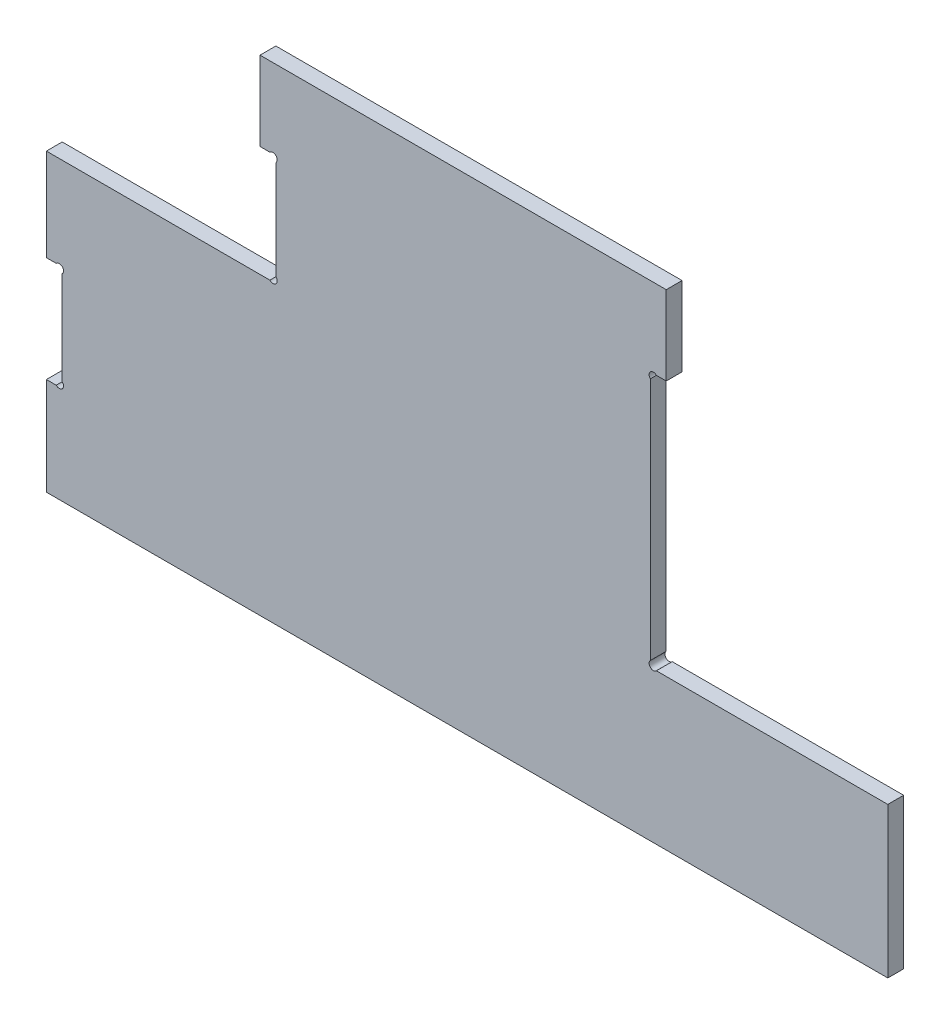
ISO-10303-21;
HEADER;
FILE_DESCRIPTION(('STEP AP214'),'2;1');
FILE_NAME('part.step','',(''),(''),'','','');
FILE_SCHEMA(('AUTOMOTIVE_DESIGN { 1 0 10303 214 1 1 1 1 }'));
ENDSEC;
DATA;
#1=APPLICATION_CONTEXT('core data for automotive mechanical design processes');
#2=APPLICATION_PROTOCOL_DEFINITION('international standard','automotive_design',2000,#1);
#3=PRODUCT_CONTEXT('',#1,'mechanical');
#4=PRODUCT('Part','Part','',(#3));
#5=PRODUCT_RELATED_PRODUCT_CATEGORY('part','',(#4));
#6=PRODUCT_DEFINITION_FORMATION('','',#4);
#7=PRODUCT_DEFINITION_CONTEXT('part definition',#1,'design');
#8=PRODUCT_DEFINITION('design','',#6,#7);
#9=PRODUCT_DEFINITION_SHAPE('','',#8);
#10=(LENGTH_UNIT() NAMED_UNIT(*) SI_UNIT(.MILLI.,.METRE.));
#11=(NAMED_UNIT(*) PLANE_ANGLE_UNIT() SI_UNIT($,.RADIAN.));
#12=(NAMED_UNIT(*) SI_UNIT($,.STERADIAN.) SOLID_ANGLE_UNIT());
#13=UNCERTAINTY_MEASURE_WITH_UNIT(LENGTH_MEASURE(1.E-05),#10,'distance_accuracy_value','');
#14=(GEOMETRIC_REPRESENTATION_CONTEXT(3) GLOBAL_UNCERTAINTY_ASSIGNED_CONTEXT((#13)) GLOBAL_UNIT_ASSIGNED_CONTEXT((#10,
#11,#12)) REPRESENTATION_CONTEXT('',''));
#15=CARTESIAN_POINT('',(0.,0.,0.));
#16=DIRECTION('',(0.,0.,1.));
#17=DIRECTION('',(1.,0.,0.));
#18=AXIS2_PLACEMENT_3D('',#15,#16,#17);
#19=CARTESIAN_POINT('',(-96.1825780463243,-108.030312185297,6.));
#20=DIRECTION('',(-1.,0.,0.));
#21=DIRECTION('',(0.,-1.,0.));
#22=AXIS2_PLACEMENT_3D('',#19,#20,#21);
#23=PLANE('',#22);
#24=DIRECTION('',(0.,0.,1.));
#25=VECTOR('',#24,1.);
#26=CARTESIAN_POINT('',(-96.1825780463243,-31.0303121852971,0.));
#27=LINE('',#26,#25);
#28=CARTESIAN_POINT('',(-96.1825780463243,-31.0303121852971,0.));
#29=VERTEX_POINT('',#28);
#30=CARTESIAN_POINT('',(-96.1825780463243,-31.0303121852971,6.));
#31=VERTEX_POINT('',#30);
#32=EDGE_CURVE('E219',#29,#31,#27,.T.);
#33=ORIENTED_EDGE('',*,*,#32,.T.);
#34=DIRECTION('',(0.,1.,0.));
#35=VECTOR('',#34,1.);
#36=CARTESIAN_POINT('',(-96.1825780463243,-108.030312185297,6.));
#37=LINE('',#36,#35);
#38=CARTESIAN_POINT('',(-96.1825780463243,3.96968781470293,6.));
#39=VERTEX_POINT('',#38);
#40=EDGE_CURVE('E222',#31,#39,#37,.T.);
#41=ORIENTED_EDGE('',*,*,#40,.T.);
#42=DIRECTION('',(0.,0.,-1.));
#43=VECTOR('',#42,1.);
#44=CARTESIAN_POINT('',(-96.1825780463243,3.96968781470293,6.));
#45=LINE('',#44,#43);
#46=CARTESIAN_POINT('',(-96.1825780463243,3.96968781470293,0.));
#47=VERTEX_POINT('',#46);
#48=EDGE_CURVE('E227',#39,#47,#45,.T.);
#49=ORIENTED_EDGE('',*,*,#48,.T.);
#50=DIRECTION('',(0.,-1.,0.));
#51=VECTOR('',#50,1.);
#52=CARTESIAN_POINT('',(-96.1825780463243,-108.030312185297,0.));
#53=LINE('',#52,#51);
#54=EDGE_CURVE('E230',#47,#29,#53,.T.);
#55=ORIENTED_EDGE('',*,*,#54,.T.);
#56=EDGE_LOOP('',(#33,#41,#49,#55));
#57=FACE_BOUND('',#56,.T.);
#58=ADVANCED_FACE('F32',(#57),#23,.T.);
#59=CARTESIAN_POINT('',(-15.1825780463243,75.9696878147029,6.));
#60=DIRECTION('',(1.,0.,0.));
#61=DIRECTION('',(0.,1.,0.));
#62=AXIS2_PLACEMENT_3D('',#59,#60,#61);
#63=PLANE('',#62);
#64=DIRECTION('',(0.,-1.,0.));
#65=VECTOR('',#64,1.);
#66=CARTESIAN_POINT('',(-15.1825780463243,75.9696878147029,0.));
#67=LINE('',#66,#65);
#68=CARTESIAN_POINT('',(-15.1825780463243,75.9696878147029,0.));
#69=VERTEX_POINT('',#68);
#70=CARTESIAN_POINT('',(-15.1825780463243,45.969687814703,0.));
#71=VERTEX_POINT('',#70);
#72=EDGE_CURVE('E264',#69,#71,#67,.T.);
#73=ORIENTED_EDGE('',*,*,#72,.T.);
#74=DIRECTION('',(0.,0.,1.));
#75=VECTOR('',#74,1.);
#76=CARTESIAN_POINT('',(-15.1825780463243,45.969687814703,0.));
#77=LINE('',#76,#75);
#78=CARTESIAN_POINT('',(-15.1825780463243,45.969687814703,6.));
#79=VERTEX_POINT('',#78);
#80=EDGE_CURVE('E196',#71,#79,#77,.T.);
#81=ORIENTED_EDGE('',*,*,#80,.T.);
#82=DIRECTION('',(0.,-1.,0.));
#83=VECTOR('',#82,1.);
#84=CARTESIAN_POINT('',(-15.1825780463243,75.9696878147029,6.));
#85=LINE('',#84,#83);
#86=CARTESIAN_POINT('',(-15.1825780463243,75.9696878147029,6.));
#87=VERTEX_POINT('',#86);
#88=EDGE_CURVE('E275',#87,#79,#85,.T.);
#89=ORIENTED_EDGE('',*,*,#88,.F.);
#90=DIRECTION('',(0.,0.,-1.));
#91=VECTOR('',#90,1.);
#92=CARTESIAN_POINT('',(-15.1825780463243,75.9696878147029,6.));
#93=LINE('',#92,#91);
#94=EDGE_CURVE('E279',#87,#69,#93,.T.);
#95=ORIENTED_EDGE('',*,*,#94,.T.);
#96=EDGE_LOOP('',(#73,#81,#89,#95));
#97=FACE_BOUND('',#96,.T.);
#98=ADVANCED_FACE('F408',(#97),#63,.F.);
#99=CARTESIAN_POINT('',(132.817421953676,75.9696878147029,6.));
#100=DIRECTION('',(-1.,0.,0.));
#101=DIRECTION('',(0.,-1.,0.));
#102=AXIS2_PLACEMENT_3D('',#99,#100,#101);
#103=PLANE('',#102);
#104=DIRECTION('',(0.,1.,0.));
#105=VECTOR('',#104,1.);
#106=CARTESIAN_POINT('',(132.817421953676,75.9696878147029,0.));
#107=LINE('',#106,#105);
#108=CARTESIAN_POINT('',(132.817421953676,-48.7684171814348,0.));
#109=VERTEX_POINT('',#108);
#110=CARTESIAN_POINT('',(132.817421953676,43.7077928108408,0.));
#111=VERTEX_POINT('',#110);
#112=EDGE_CURVE('E259',#109,#111,#107,.T.);
#113=ORIENTED_EDGE('',*,*,#112,.T.);
#114=DIRECTION('',(0.,0.,-1.));
#115=VECTOR('',#114,1.);
#116=CARTESIAN_POINT('',(132.817421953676,43.7077928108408,6.));
#117=LINE('',#116,#115);
#118=CARTESIAN_POINT('',(132.817421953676,43.7077928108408,6.));
#119=VERTEX_POINT('',#118);
#120=EDGE_CURVE('E355',#111,#119,#117,.F.);
#121=ORIENTED_EDGE('',*,*,#120,.T.);
#122=DIRECTION('',(0.,1.,0.));
#123=VECTOR('',#122,1.);
#124=CARTESIAN_POINT('',(132.817421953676,75.9696878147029,6.));
#125=LINE('',#124,#123);
#126=CARTESIAN_POINT('',(132.817421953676,-48.7684171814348,6.));
#127=VERTEX_POINT('',#126);
#128=EDGE_CURVE('E457',#127,#119,#125,.T.);
#129=ORIENTED_EDGE('',*,*,#128,.F.);
#130=DIRECTION('',(0.,0.,-1.));
#131=VECTOR('',#130,1.);
#132=CARTESIAN_POINT('',(132.817421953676,-48.7684171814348,6.));
#133=LINE('',#132,#131);
#134=EDGE_CURVE('E364',#127,#109,#133,.T.);
#135=ORIENTED_EDGE('',*,*,#134,.T.);
#136=EDGE_LOOP('',(#113,#121,#129,#135));
#137=FACE_BOUND('',#136,.T.);
#138=ADVANCED_FACE('F413',(#137),#103,.F.);
#139=CARTESIAN_POINT('',(222.817421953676,-51.030312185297,6.));
#140=DIRECTION('',(-1.,0.,0.));
#141=DIRECTION('',(0.,0.,1.));
#142=AXIS2_PLACEMENT_3D('',#139,#140,#141);
#143=PLANE('',#142);
#144=DIRECTION('',(0.,1.,0.));
#145=VECTOR('',#144,1.);
#146=CARTESIAN_POINT('',(222.817421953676,-51.030312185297,0.));
#147=LINE('',#146,#145);
#148=CARTESIAN_POINT('',(222.817421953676,-108.030312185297,0.));
#149=VERTEX_POINT('',#148);
#150=CARTESIAN_POINT('',(222.817421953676,-51.030312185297,0.));
#151=VERTEX_POINT('',#150);
#152=EDGE_CURVE('E254',#149,#151,#147,.T.);
#153=ORIENTED_EDGE('',*,*,#152,.T.);
#154=DIRECTION('',(0.,0.,-1.));
#155=VECTOR('',#154,1.);
#156=CARTESIAN_POINT('',(222.817421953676,-51.030312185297,6.));
#157=LINE('',#156,#155);
#158=CARTESIAN_POINT('',(222.817421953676,-51.030312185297,6.));
#159=VERTEX_POINT('',#158);
#160=EDGE_CURVE('E287',#159,#151,#157,.T.);
#161=ORIENTED_EDGE('',*,*,#160,.F.);
#162=DIRECTION('',(0.,1.,0.));
#163=VECTOR('',#162,1.);
#164=CARTESIAN_POINT('',(222.817421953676,-51.030312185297,6.));
#165=LINE('',#164,#163);
#166=CARTESIAN_POINT('',(222.817421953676,-108.030312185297,6.));
#167=VERTEX_POINT('',#166);
#168=EDGE_CURVE('E455',#167,#159,#165,.T.);
#169=ORIENTED_EDGE('',*,*,#168,.F.);
#170=DIRECTION('',(0.,0.,-1.));
#171=VECTOR('',#170,1.);
#172=CARTESIAN_POINT('',(222.817421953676,-108.030312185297,6.));
#173=LINE('',#172,#171);
#174=EDGE_CURVE('E273',#167,#149,#173,.T.);
#175=ORIENTED_EDGE('',*,*,#174,.T.);
#176=EDGE_LOOP('',(#153,#161,#169,#175));
#177=FACE_BOUND('',#176,.T.);
#178=ADVANCED_FACE('F34',(#177),#143,.F.);
#179=CARTESIAN_POINT('',(132.817421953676,-51.030312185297,6.));
#180=DIRECTION('',(0.,-1.,0.));
#181=DIRECTION('',(0.,0.,-1.));
#182=AXIS2_PLACEMENT_3D('',#179,#180,#181);
#183=PLANE('',#182);
#184=DIRECTION('',(-1.,0.,0.));
#185=VECTOR('',#184,1.);
#186=CARTESIAN_POINT('',(132.817421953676,-51.030312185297,0.));
#187=LINE('',#186,#185);
#188=CARTESIAN_POINT('',(135.079316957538,-51.030312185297,0.));
#189=VERTEX_POINT('',#188);
#190=EDGE_CURVE('E256',#151,#189,#187,.T.);
#191=ORIENTED_EDGE('',*,*,#190,.T.);
#192=DIRECTION('',(0.,0.,-1.));
#193=VECTOR('',#192,1.);
#194=CARTESIAN_POINT('',(135.079316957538,-51.030312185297,6.));
#195=LINE('',#194,#193);
#196=CARTESIAN_POINT('',(135.079316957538,-51.030312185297,6.));
#197=VERTEX_POINT('',#196);
#198=EDGE_CURVE('E361',#189,#197,#195,.F.);
#199=ORIENTED_EDGE('',*,*,#198,.T.);
#200=DIRECTION('',(-1.,0.,0.));
#201=VECTOR('',#200,1.);
#202=CARTESIAN_POINT('',(132.817421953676,-51.030312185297,6.));
#203=LINE('',#202,#201);
#204=EDGE_CURVE('E456',#159,#197,#203,.T.);
#205=ORIENTED_EDGE('',*,*,#204,.F.);
#206=ORIENTED_EDGE('',*,*,#160,.T.);
#207=EDGE_LOOP('',(#191,#199,#205,#206));
#208=FACE_BOUND('',#207,.T.);
#209=ADVANCED_FACE('F446',(#208),#183,.F.);
#210=CARTESIAN_POINT('',(-15.1825780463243,75.9696878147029,6.));
#211=DIRECTION('',(0.,-1.,0.));
#212=DIRECTION('',(0.,0.,-1.));
#213=AXIS2_PLACEMENT_3D('',#210,#211,#212);
#214=PLANE('',#213);
#215=DIRECTION('',(-1.,0.,0.));
#216=VECTOR('',#215,1.);
#217=CARTESIAN_POINT('',(-15.1825780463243,75.9696878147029,0.));
#218=LINE('',#217,#216);
#219=CARTESIAN_POINT('',(138.817421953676,75.969687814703,0.));
#220=VERTEX_POINT('',#219);
#221=EDGE_CURVE('E262',#220,#69,#218,.T.);
#222=ORIENTED_EDGE('',*,*,#221,.T.);
#223=ORIENTED_EDGE('',*,*,#94,.F.);
#224=DIRECTION('',(-1.,0.,0.));
#225=VECTOR('',#224,1.);
#226=CARTESIAN_POINT('',(-15.1825780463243,75.9696878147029,6.));
#227=LINE('',#226,#225);
#228=CARTESIAN_POINT('',(138.817421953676,75.969687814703,6.));
#229=VERTEX_POINT('',#228);
#230=EDGE_CURVE('E280',#229,#87,#227,.T.);
#231=ORIENTED_EDGE('',*,*,#230,.F.);
#232=DIRECTION('',(0.,0.,1.));
#233=VECTOR('',#232,1.);
#234=CARTESIAN_POINT('',(138.817421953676,75.969687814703,6.));
#235=LINE('',#234,#233);
#236=EDGE_CURVE('E245',#220,#229,#235,.T.);
#237=ORIENTED_EDGE('',*,*,#236,.F.);
#238=EDGE_LOOP('',(#222,#223,#231,#237));
#239=FACE_BOUND('',#238,.T.);
#240=ADVANCED_FACE('F441',(#239),#214,.F.);
#241=CARTESIAN_POINT('',(118.817421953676,-108.030312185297,6.));
#242=DIRECTION('',(0.,1.,0.));
#243=DIRECTION('',(-1.,0.,0.));
#244=AXIS2_PLACEMENT_3D('',#241,#242,#243);
#245=PLANE('',#244);
#246=DIRECTION('',(1.,0.,0.));
#247=VECTOR('',#246,1.);
#248=CARTESIAN_POINT('',(118.817421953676,-108.030312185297,0.));
#249=LINE('',#248,#247);
#250=CARTESIAN_POINT('',(-96.1825780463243,-108.030312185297,0.));
#251=VERTEX_POINT('',#250);
#252=EDGE_CURVE('E267',#251,#149,#249,.T.);
#253=ORIENTED_EDGE('',*,*,#252,.T.);
#254=ORIENTED_EDGE('',*,*,#174,.F.);
#255=DIRECTION('',(1.,0.,0.));
#256=VECTOR('',#255,1.);
#257=CARTESIAN_POINT('',(222.817421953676,-108.030312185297,6.));
#258=LINE('',#257,#256);
#259=CARTESIAN_POINT('',(-96.1825780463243,-108.030312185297,6.));
#260=VERTEX_POINT('',#259);
#261=EDGE_CURVE('E460',#260,#167,#258,.T.);
#262=ORIENTED_EDGE('',*,*,#261,.F.);
#263=DIRECTION('',(0.,0.,1.));
#264=VECTOR('',#263,1.);
#265=CARTESIAN_POINT('',(-96.1825780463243,-108.030312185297,6.));
#266=LINE('',#265,#264);
#267=EDGE_CURVE('E233',#251,#260,#266,.T.);
#268=ORIENTED_EDGE('',*,*,#267,.F.);
#269=EDGE_LOOP('',(#253,#254,#262,#268));
#270=FACE_BOUND('',#269,.T.);
#271=ADVANCED_FACE('F439',(#270),#245,.F.);
#272=CARTESIAN_POINT('',(132.817421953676,-108.030312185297,6.));
#273=DIRECTION('',(0.,0.,1.));
#274=DIRECTION('',(1.,0.,0.));
#275=AXIS2_PLACEMENT_3D('',#272,#273,#274);
#276=PLANE('',#275);
#277=CARTESIAN_POINT('',(-10.2825780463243,5.06968781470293,6.));
#278=DIRECTION('',(0.,0.,-1.));
#279=DIRECTION('',(-1.,0.,0.));
#280=AXIS2_PLACEMENT_3D('',#277,#278,#279);
#281=CIRCLE('',#280,1.6);
#282=CARTESIAN_POINT('',(-9.18257804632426,6.23158281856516,6.));
#283=VERTEX_POINT('',#282);
#284=CARTESIAN_POINT('',(-11.4444730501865,3.96968781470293,6.));
#285=VERTEX_POINT('',#284);
#286=EDGE_CURVE('E47',#283,#285,#281,.T.);
#287=ORIENTED_EDGE('',*,*,#286,.T.);
#288=DIRECTION('',(1.,0.,0.));
#289=VECTOR('',#288,1.);
#290=CARTESIAN_POINT('',(-96.1825780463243,3.96968781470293,6.));
#291=LINE('',#290,#289);
#292=EDGE_CURVE('E240',#39,#285,#291,.T.);
#293=ORIENTED_EDGE('',*,*,#292,.F.);
#294=ORIENTED_EDGE('',*,*,#40,.F.);
#295=DIRECTION('',(-1.,0.,0.));
#296=VECTOR('',#295,1.);
#297=CARTESIAN_POINT('',(-96.1825780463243,-31.0303121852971,6.));
#298=LINE('',#297,#296);
#299=CARTESIAN_POINT('',(-92.4444730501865,-31.0303121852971,6.));
#300=VERTEX_POINT('',#299);
#301=EDGE_CURVE('E209',#300,#31,#298,.T.);
#302=ORIENTED_EDGE('',*,*,#301,.F.);
#303=CARTESIAN_POINT('',(-91.2825780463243,-32.1303121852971,6.));
#304=DIRECTION('',(0.,0.,-1.));
#305=DIRECTION('',(-1.,0.,0.));
#306=AXIS2_PLACEMENT_3D('',#303,#304,#305);
#307=CIRCLE('',#306,1.60000000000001);
#308=CARTESIAN_POINT('',(-90.1825780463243,-33.2922071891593,6.));
#309=VERTEX_POINT('',#308);
#310=EDGE_CURVE('E345',#300,#309,#307,.T.);
#311=ORIENTED_EDGE('',*,*,#310,.T.);
#312=DIRECTION('',(0.,1.,0.));
#313=VECTOR('',#312,1.);
#314=CARTESIAN_POINT('',(-90.1825780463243,-31.0303121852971,6.));
#315=LINE('',#314,#313);
#316=CARTESIAN_POINT('',(-90.1825780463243,-68.7684171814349,6.));
#317=VERTEX_POINT('',#316);
#318=EDGE_CURVE('E207',#317,#309,#315,.T.);
#319=ORIENTED_EDGE('',*,*,#318,.F.);
#320=CARTESIAN_POINT('',(-91.2825780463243,-69.9303121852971,6.));
#321=DIRECTION('',(0.,0.,-1.));
#322=DIRECTION('',(-1.,0.,0.));
#323=AXIS2_PLACEMENT_3D('',#320,#321,#322);
#324=CIRCLE('',#323,1.60000000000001);
#325=CARTESIAN_POINT('',(-92.4444730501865,-71.0303121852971,6.));
#326=VERTEX_POINT('',#325);
#327=EDGE_CURVE('E332',#317,#326,#324,.T.);
#328=ORIENTED_EDGE('',*,*,#327,.T.);
#329=DIRECTION('',(1.,0.,0.));
#330=VECTOR('',#329,1.);
#331=CARTESIAN_POINT('',(-96.1825780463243,-71.0303121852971,6.));
#332=LINE('',#331,#330);
#333=CARTESIAN_POINT('',(-96.1825780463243,-71.0303121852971,6.));
#334=VERTEX_POINT('',#333);
#335=EDGE_CURVE('E204',#334,#326,#332,.T.);
#336=ORIENTED_EDGE('',*,*,#335,.F.);
#337=EDGE_CURVE('E224',#260,#334,#37,.T.);
#338=ORIENTED_EDGE('',*,*,#337,.F.);
#339=ORIENTED_EDGE('',*,*,#261,.T.);
#340=ORIENTED_EDGE('',*,*,#168,.T.);
#341=ORIENTED_EDGE('',*,*,#204,.T.);
#342=CARTESIAN_POINT('',(133.917421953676,-49.930312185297,6.));
#343=DIRECTION('',(0.,0.,-1.));
#344=DIRECTION('',(-1.,0.,0.));
#345=AXIS2_PLACEMENT_3D('',#342,#343,#344);
#346=CIRCLE('',#345,1.60000000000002);
#347=EDGE_CURVE('E358',#197,#127,#346,.T.);
#348=ORIENTED_EDGE('',*,*,#347,.T.);
#349=ORIENTED_EDGE('',*,*,#128,.T.);
#350=CARTESIAN_POINT('',(133.917421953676,44.869687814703,6.));
#351=DIRECTION('',(0.,0.,-1.));
#352=DIRECTION('',(-1.,0.,0.));
#353=AXIS2_PLACEMENT_3D('',#350,#351,#352);
#354=CIRCLE('',#353,1.59999999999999);
#355=CARTESIAN_POINT('',(135.079316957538,45.969687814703,6.));
#356=VERTEX_POINT('',#355);
#357=EDGE_CURVE('E352',#119,#356,#354,.T.);
#358=ORIENTED_EDGE('',*,*,#357,.T.);
#359=DIRECTION('',(-1.,0.,0.));
#360=VECTOR('',#359,1.);
#361=CARTESIAN_POINT('',(138.817421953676,45.969687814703,6.));
#362=LINE('',#361,#360);
#363=CARTESIAN_POINT('',(138.817421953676,45.969687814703,6.));
#364=VERTEX_POINT('',#363);
#365=EDGE_CURVE('E251',#364,#356,#362,.T.);
#366=ORIENTED_EDGE('',*,*,#365,.F.);
#367=DIRECTION('',(0.,-1.,0.));
#368=VECTOR('',#367,1.);
#369=CARTESIAN_POINT('',(138.817421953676,75.969687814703,6.));
#370=LINE('',#369,#368);
#371=EDGE_CURVE('E236',#229,#364,#370,.T.);
#372=ORIENTED_EDGE('',*,*,#371,.F.);
#373=ORIENTED_EDGE('',*,*,#230,.T.);
#374=ORIENTED_EDGE('',*,*,#88,.T.);
#375=DIRECTION('',(-1.,0.,0.));
#376=VECTOR('',#375,1.);
#377=CARTESIAN_POINT('',(-15.1825780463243,45.969687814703,6.));
#378=LINE('',#377,#376);
#379=CARTESIAN_POINT('',(-11.4444730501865,45.969687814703,6.));
#380=VERTEX_POINT('',#379);
#381=EDGE_CURVE('E194',#380,#79,#378,.T.);
#382=ORIENTED_EDGE('',*,*,#381,.F.);
#383=CARTESIAN_POINT('',(-10.2825780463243,44.869687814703,6.));
#384=DIRECTION('',(0.,0.,-1.));
#385=DIRECTION('',(-1.,0.,0.));
#386=AXIS2_PLACEMENT_3D('',#383,#384,#385);
#387=CIRCLE('',#386,1.6);
#388=CARTESIAN_POINT('',(-9.18257804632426,43.7077928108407,6.));
#389=VERTEX_POINT('',#388);
#390=EDGE_CURVE('E369',#380,#389,#387,.T.);
#391=ORIENTED_EDGE('',*,*,#390,.T.);
#392=DIRECTION('',(0.,1.,0.));
#393=VECTOR('',#392,1.);
#394=CARTESIAN_POINT('',(-9.18257804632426,45.969687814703,6.));
#395=LINE('',#394,#393);
#396=EDGE_CURVE('E198',#283,#389,#395,.T.);
#397=ORIENTED_EDGE('',*,*,#396,.F.);
#398=EDGE_LOOP('',(#287,#293,#294,#302,#311,#319,#328,#336,#338,#339,#340,#341,#348,#349,#358,
#366,#372,#373,#374,#382,#391,#397));
#399=FACE_BOUND('',#398,.T.);
#400=ADVANCED_FACE('F329',(#399),#276,.T.);
#401=CARTESIAN_POINT('',(132.817421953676,-108.030312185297,0.));
#402=DIRECTION('',(0.,0.,1.));
#403=DIRECTION('',(1.,0.,0.));
#404=AXIS2_PLACEMENT_3D('',#401,#402,#403);
#405=PLANE('',#404);
#406=DIRECTION('',(1.,0.,0.));
#407=VECTOR('',#406,1.);
#408=CARTESIAN_POINT('',(-96.1825780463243,3.96968781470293,0.));
#409=LINE('',#408,#407);
#410=CARTESIAN_POINT('',(-11.4444730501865,3.96968781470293,0.));
#411=VERTEX_POINT('',#410);
#412=EDGE_CURVE('E188',#47,#411,#409,.T.);
#413=ORIENTED_EDGE('',*,*,#412,.T.);
#414=CARTESIAN_POINT('',(-10.2825780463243,5.06968781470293,0.));
#415=DIRECTION('',(0.,0.,-1.));
#416=DIRECTION('',(-1.,0.,0.));
#417=AXIS2_PLACEMENT_3D('',#414,#415,#416);
#418=CIRCLE('',#417,1.6);
#419=CARTESIAN_POINT('',(-9.18257804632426,6.23158281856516,0.));
#420=VERTEX_POINT('',#419);
#421=EDGE_CURVE('E180',#420,#411,#418,.T.);
#422=ORIENTED_EDGE('',*,*,#421,.F.);
#423=DIRECTION('',(0.,1.,0.));
#424=VECTOR('',#423,1.);
#425=CARTESIAN_POINT('',(-9.18257804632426,45.969687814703,0.));
#426=LINE('',#425,#424);
#427=CARTESIAN_POINT('',(-9.18257804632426,43.7077928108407,0.));
#428=VERTEX_POINT('',#427);
#429=EDGE_CURVE('E54',#420,#428,#426,.T.);
#430=ORIENTED_EDGE('',*,*,#429,.T.);
#431=CARTESIAN_POINT('',(-10.2825780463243,44.869687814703,0.));
#432=DIRECTION('',(0.,0.,-1.));
#433=DIRECTION('',(-1.,0.,0.));
#434=AXIS2_PLACEMENT_3D('',#431,#432,#433);
#435=CIRCLE('',#434,1.6);
#436=CARTESIAN_POINT('',(-11.4444730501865,45.969687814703,0.));
#437=VERTEX_POINT('',#436);
#438=EDGE_CURVE('E371',#437,#428,#435,.T.);
#439=ORIENTED_EDGE('',*,*,#438,.F.);
#440=DIRECTION('',(-1.,0.,0.));
#441=VECTOR('',#440,1.);
#442=CARTESIAN_POINT('',(-15.1825780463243,45.969687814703,0.));
#443=LINE('',#442,#441);
#444=EDGE_CURVE('E193',#437,#71,#443,.T.);
#445=ORIENTED_EDGE('',*,*,#444,.T.);
#446=ORIENTED_EDGE('',*,*,#72,.F.);
#447=ORIENTED_EDGE('',*,*,#221,.F.);
#448=DIRECTION('',(0.,1.,0.));
#449=VECTOR('',#448,1.);
#450=CARTESIAN_POINT('',(138.817421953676,75.969687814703,0.));
#451=LINE('',#450,#449);
#452=CARTESIAN_POINT('',(138.817421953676,45.969687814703,0.));
#453=VERTEX_POINT('',#452);
#454=EDGE_CURVE('E242',#453,#220,#451,.T.);
#455=ORIENTED_EDGE('',*,*,#454,.F.);
#456=DIRECTION('',(-1.,0.,0.));
#457=VECTOR('',#456,1.);
#458=CARTESIAN_POINT('',(138.817421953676,45.969687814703,0.));
#459=LINE('',#458,#457);
#460=CARTESIAN_POINT('',(135.079316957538,45.969687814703,0.));
#461=VERTEX_POINT('',#460);
#462=EDGE_CURVE('E248',#453,#461,#459,.T.);
#463=ORIENTED_EDGE('',*,*,#462,.T.);
#464=CARTESIAN_POINT('',(133.917421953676,44.869687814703,0.));
#465=DIRECTION('',(0.,0.,-1.));
#466=DIRECTION('',(-1.,0.,0.));
#467=AXIS2_PLACEMENT_3D('',#464,#465,#466);
#468=CIRCLE('',#467,1.59999999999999);
#469=EDGE_CURVE('E350',#111,#461,#468,.T.);
#470=ORIENTED_EDGE('',*,*,#469,.F.);
#471=ORIENTED_EDGE('',*,*,#112,.F.);
#472=CARTESIAN_POINT('',(133.917421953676,-49.930312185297,0.));
#473=DIRECTION('',(0.,0.,1.));
#474=DIRECTION('',(1.,0.,0.));
#475=AXIS2_PLACEMENT_3D('',#472,#473,#474);
#476=CIRCLE('',#475,1.60000000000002);
#477=EDGE_CURVE('E294',#109,#189,#476,.T.);
#478=ORIENTED_EDGE('',*,*,#477,.T.);
#479=ORIENTED_EDGE('',*,*,#190,.F.);
#480=ORIENTED_EDGE('',*,*,#152,.F.);
#481=ORIENTED_EDGE('',*,*,#252,.F.);
#482=CARTESIAN_POINT('',(-96.1825780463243,-71.0303121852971,0.));
#483=VERTEX_POINT('',#482);
#484=EDGE_CURVE('E229',#483,#251,#53,.T.);
#485=ORIENTED_EDGE('',*,*,#484,.F.);
#486=DIRECTION('',(1.,0.,0.));
#487=VECTOR('',#486,1.);
#488=CARTESIAN_POINT('',(-96.1825780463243,-71.0303121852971,0.));
#489=LINE('',#488,#487);
#490=CARTESIAN_POINT('',(-92.4444730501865,-71.0303121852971,0.));
#491=VERTEX_POINT('',#490);
#492=EDGE_CURVE('E211',#483,#491,#489,.T.);
#493=ORIENTED_EDGE('',*,*,#492,.T.);
#494=CARTESIAN_POINT('',(-91.2825780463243,-69.9303121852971,0.));
#495=DIRECTION('',(0.,0.,-1.));
#496=DIRECTION('',(-1.,0.,0.));
#497=AXIS2_PLACEMENT_3D('',#494,#495,#496);
#498=CIRCLE('',#497,1.60000000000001);
#499=CARTESIAN_POINT('',(-90.1825780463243,-68.7684171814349,0.));
#500=VERTEX_POINT('',#499);
#501=EDGE_CURVE('E320',#500,#491,#498,.T.);
#502=ORIENTED_EDGE('',*,*,#501,.F.);
#503=DIRECTION('',(0.,1.,0.));
#504=VECTOR('',#503,1.);
#505=CARTESIAN_POINT('',(-90.1825780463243,-31.0303121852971,0.));
#506=LINE('',#505,#504);
#507=CARTESIAN_POINT('',(-90.1825780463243,-33.2922071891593,0.));
#508=VERTEX_POINT('',#507);
#509=EDGE_CURVE('E214',#500,#508,#506,.T.);
#510=ORIENTED_EDGE('',*,*,#509,.T.);
#511=CARTESIAN_POINT('',(-91.2825780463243,-32.1303121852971,0.));
#512=DIRECTION('',(0.,0.,-1.));
#513=DIRECTION('',(-1.,0.,0.));
#514=AXIS2_PLACEMENT_3D('',#511,#512,#513);
#515=CIRCLE('',#514,1.60000000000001);
#516=CARTESIAN_POINT('',(-92.4444730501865,-31.0303121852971,0.));
#517=VERTEX_POINT('',#516);
#518=EDGE_CURVE('E337',#517,#508,#515,.T.);
#519=ORIENTED_EDGE('',*,*,#518,.F.);
#520=DIRECTION('',(-1.,0.,0.));
#521=VECTOR('',#520,1.);
#522=CARTESIAN_POINT('',(-96.1825780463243,-31.0303121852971,0.));
#523=LINE('',#522,#521);
#524=EDGE_CURVE('E216',#517,#29,#523,.T.);
#525=ORIENTED_EDGE('',*,*,#524,.T.);
#526=ORIENTED_EDGE('',*,*,#54,.F.);
#527=EDGE_LOOP('',(#413,#422,#430,#439,#445,#446,#447,#455,#463,#470,#471,#478,#479,#480,#481,
#485,#493,#502,#510,#519,#525,#526));
#528=FACE_BOUND('',#527,.T.);
#529=ADVANCED_FACE('F185',(#528),#405,.F.);
#530=CARTESIAN_POINT('',(138.817421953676,45.969687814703,6.));
#531=DIRECTION('',(0.,1.,0.));
#532=DIRECTION('',(0.,0.,1.));
#533=AXIS2_PLACEMENT_3D('',#530,#531,#532);
#534=PLANE('',#533);
#535=ORIENTED_EDGE('',*,*,#365,.T.);
#536=DIRECTION('',(0.,0.,-1.));
#537=VECTOR('',#536,1.);
#538=CARTESIAN_POINT('',(135.079316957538,45.969687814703,6.));
#539=LINE('',#538,#537);
#540=EDGE_CURVE('E298',#356,#461,#539,.T.);
#541=ORIENTED_EDGE('',*,*,#540,.T.);
#542=ORIENTED_EDGE('',*,*,#462,.F.);
#543=DIRECTION('',(0.,0.,-1.));
#544=VECTOR('',#543,1.);
#545=CARTESIAN_POINT('',(138.817421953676,45.969687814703,6.));
#546=LINE('',#545,#544);
#547=EDGE_CURVE('E239',#364,#453,#546,.T.);
#548=ORIENTED_EDGE('',*,*,#547,.F.);
#549=EDGE_LOOP('',(#535,#541,#542,#548));
#550=FACE_BOUND('',#549,.T.);
#551=ADVANCED_FACE('F428',(#550),#534,.F.);
#552=CARTESIAN_POINT('',(138.817421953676,75.969687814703,6.));
#553=DIRECTION('',(1.,0.,0.));
#554=DIRECTION('',(0.,1.,0.));
#555=AXIS2_PLACEMENT_3D('',#552,#553,#554);
#556=PLANE('',#555);
#557=ORIENTED_EDGE('',*,*,#371,.T.);
#558=ORIENTED_EDGE('',*,*,#547,.T.);
#559=ORIENTED_EDGE('',*,*,#454,.T.);
#560=ORIENTED_EDGE('',*,*,#236,.T.);
#561=EDGE_LOOP('',(#557,#558,#559,#560));
#562=FACE_BOUND('',#561,.T.);
#563=ADVANCED_FACE('F424',(#562),#556,.T.);
#564=CARTESIAN_POINT('',(-96.1825780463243,3.96968781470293,6.));
#565=DIRECTION('',(0.,-1.,0.));
#566=DIRECTION('',(0.,0.,-1.));
#567=AXIS2_PLACEMENT_3D('',#564,#565,#566);
#568=PLANE('',#567);
#569=ORIENTED_EDGE('',*,*,#292,.T.);
#570=DIRECTION('',(0.,0.,-1.));
#571=VECTOR('',#570,1.);
#572=CARTESIAN_POINT('',(-11.4444730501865,3.96968781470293,6.));
#573=LINE('',#572,#571);
#574=EDGE_CURVE('E374',#285,#411,#573,.T.);
#575=ORIENTED_EDGE('',*,*,#574,.T.);
#576=ORIENTED_EDGE('',*,*,#412,.F.);
#577=ORIENTED_EDGE('',*,*,#48,.F.);
#578=EDGE_LOOP('',(#569,#575,#576,#577));
#579=FACE_BOUND('',#578,.T.);
#580=ADVANCED_FACE('F383',(#579),#568,.F.);
#581=DIRECTION('',(0.,0.,1.));
#582=VECTOR('',#581,1.);
#583=CARTESIAN_POINT('',(-96.1825780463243,-71.0303121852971,0.));
#584=LINE('',#583,#582);
#585=EDGE_CURVE('E218',#483,#334,#584,.T.);
#586=ORIENTED_EDGE('',*,*,#585,.F.);
#587=ORIENTED_EDGE('',*,*,#484,.T.);
#588=ORIENTED_EDGE('',*,*,#267,.T.);
#589=ORIENTED_EDGE('',*,*,#337,.T.);
#590=EDGE_LOOP('',(#586,#587,#588,#589));
#591=FACE_BOUND('',#590,.T.);
#592=ADVANCED_FACE('F326',(#591),#23,.T.);
#593=CARTESIAN_POINT('',(-96.1825780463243,-31.0303121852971,0.));
#594=DIRECTION('',(0.,1.,0.));
#595=DIRECTION('',(-1.,0.,0.));
#596=AXIS2_PLACEMENT_3D('',#593,#594,#595);
#597=PLANE('',#596);
#598=ORIENTED_EDGE('',*,*,#524,.F.);
#599=DIRECTION('',(0.,0.,-1.));
#600=VECTOR('',#599,1.);
#601=CARTESIAN_POINT('',(-92.4444730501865,-31.0303121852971,6.));
#602=LINE('',#601,#600);
#603=EDGE_CURVE('E347',#517,#300,#602,.F.);
#604=ORIENTED_EDGE('',*,*,#603,.T.);
#605=ORIENTED_EDGE('',*,*,#301,.T.);
#606=ORIENTED_EDGE('',*,*,#32,.F.);
#607=EDGE_LOOP('',(#598,#604,#605,#606));
#608=FACE_BOUND('',#607,.T.);
#609=ADVANCED_FACE('F390',(#608),#597,.F.);
#610=CARTESIAN_POINT('',(-90.1825780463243,-31.0303121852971,0.));
#611=DIRECTION('',(1.,0.,0.));
#612=DIRECTION('',(0.,0.,-1.));
#613=AXIS2_PLACEMENT_3D('',#610,#611,#612);
#614=PLANE('',#613);
#615=ORIENTED_EDGE('',*,*,#509,.F.);
#616=DIRECTION('',(0.,0.,-1.));
#617=VECTOR('',#616,1.);
#618=CARTESIAN_POINT('',(-90.1825780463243,-68.7684171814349,6.));
#619=LINE('',#618,#617);
#620=EDGE_CURVE('E335',#500,#317,#619,.F.);
#621=ORIENTED_EDGE('',*,*,#620,.T.);
#622=ORIENTED_EDGE('',*,*,#318,.T.);
#623=DIRECTION('',(0.,0.,-1.));
#624=VECTOR('',#623,1.);
#625=CARTESIAN_POINT('',(-90.1825780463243,-33.2922071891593,6.));
#626=LINE('',#625,#624);
#627=EDGE_CURVE('E302',#309,#508,#626,.T.);
#628=ORIENTED_EDGE('',*,*,#627,.T.);
#629=EDGE_LOOP('',(#615,#621,#622,#628));
#630=FACE_BOUND('',#629,.T.);
#631=ADVANCED_FACE('F396',(#630),#614,.F.);
#632=CARTESIAN_POINT('',(-96.1825780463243,-71.0303121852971,0.));
#633=DIRECTION('',(0.,-1.,0.));
#634=DIRECTION('',(0.,0.,-1.));
#635=AXIS2_PLACEMENT_3D('',#632,#633,#634);
#636=PLANE('',#635);
#637=ORIENTED_EDGE('',*,*,#335,.T.);
#638=DIRECTION('',(0.,0.,-1.));
#639=VECTOR('',#638,1.);
#640=CARTESIAN_POINT('',(-92.4444730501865,-71.0303121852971,6.));
#641=LINE('',#640,#639);
#642=EDGE_CURVE('E310',#326,#491,#641,.T.);
#643=ORIENTED_EDGE('',*,*,#642,.T.);
#644=ORIENTED_EDGE('',*,*,#492,.F.);
#645=ORIENTED_EDGE('',*,*,#585,.T.);
#646=EDGE_LOOP('',(#637,#643,#644,#645));
#647=FACE_BOUND('',#646,.T.);
#648=ADVANCED_FACE('F313',(#647),#636,.F.);
#649=CARTESIAN_POINT('',(-15.1825780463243,45.969687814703,0.));
#650=DIRECTION('',(0.,1.,0.));
#651=DIRECTION('',(0.,0.,1.));
#652=AXIS2_PLACEMENT_3D('',#649,#650,#651);
#653=PLANE('',#652);
#654=ORIENTED_EDGE('',*,*,#444,.F.);
#655=DIRECTION('',(0.,0.,-1.));
#656=VECTOR('',#655,1.);
#657=CARTESIAN_POINT('',(-11.4444730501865,45.969687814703,6.));
#658=LINE('',#657,#656);
#659=EDGE_CURVE('E339',#437,#380,#658,.F.);
#660=ORIENTED_EDGE('',*,*,#659,.T.);
#661=ORIENTED_EDGE('',*,*,#381,.T.);
#662=ORIENTED_EDGE('',*,*,#80,.F.);
#663=EDGE_LOOP('',(#654,#660,#661,#662));
#664=FACE_BOUND('',#663,.T.);
#665=ADVANCED_FACE('F472',(#664),#653,.F.);
#666=CARTESIAN_POINT('',(-9.18257804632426,45.969687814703,0.));
#667=DIRECTION('',(1.,0.,0.));
#668=DIRECTION('',(0.,1.,0.));
#669=AXIS2_PLACEMENT_3D('',#666,#667,#668);
#670=PLANE('',#669);
#671=ORIENTED_EDGE('',*,*,#429,.F.);
#672=DIRECTION('',(0.,0.,-1.));
#673=VECTOR('',#672,1.);
#674=CARTESIAN_POINT('',(-9.18257804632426,6.23158281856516,6.));
#675=LINE('',#674,#673);
#676=EDGE_CURVE('E11',#420,#283,#675,.F.);
#677=ORIENTED_EDGE('',*,*,#676,.T.);
#678=ORIENTED_EDGE('',*,*,#396,.T.);
#679=DIRECTION('',(0.,0.,-1.));
#680=VECTOR('',#679,1.);
#681=CARTESIAN_POINT('',(-9.18257804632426,43.7077928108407,6.));
#682=LINE('',#681,#680);
#683=EDGE_CURVE('E40',#389,#428,#682,.T.);
#684=ORIENTED_EDGE('',*,*,#683,.T.);
#685=EDGE_LOOP('',(#671,#677,#678,#684));
#686=FACE_BOUND('',#685,.T.);
#687=ADVANCED_FACE('F191',(#686),#670,.F.);
#688=CARTESIAN_POINT('',(133.917421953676,-49.930312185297,6.));
#689=DIRECTION('',(0.,0.,-1.));
#690=DIRECTION('',(-1.,0.,0.));
#691=AXIS2_PLACEMENT_3D('',#688,#689,#690);
#692=CYLINDRICAL_SURFACE('',#691,1.60000000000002);
#693=ORIENTED_EDGE('',*,*,#347,.F.);
#694=ORIENTED_EDGE('',*,*,#198,.F.);
#695=ORIENTED_EDGE('',*,*,#477,.F.);
#696=ORIENTED_EDGE('',*,*,#134,.F.);
#697=EDGE_LOOP('',(#693,#694,#695,#696));
#698=FACE_BOUND('',#697,.T.);
#699=ADVANCED_FACE('F478',(#698),#692,.F.);
#700=CARTESIAN_POINT('',(133.917421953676,44.869687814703,6.));
#701=DIRECTION('',(0.,0.,-1.));
#702=DIRECTION('',(-1.,0.,0.));
#703=AXIS2_PLACEMENT_3D('',#700,#701,#702);
#704=CYLINDRICAL_SURFACE('',#703,1.59999999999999);
#705=ORIENTED_EDGE('',*,*,#469,.T.);
#706=ORIENTED_EDGE('',*,*,#540,.F.);
#707=ORIENTED_EDGE('',*,*,#357,.F.);
#708=ORIENTED_EDGE('',*,*,#120,.F.);
#709=EDGE_LOOP('',(#705,#706,#707,#708));
#710=FACE_BOUND('',#709,.T.);
#711=ADVANCED_FACE('F405',(#710),#704,.F.);
#712=CARTESIAN_POINT('',(-91.2825780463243,-32.1303121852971,6.));
#713=DIRECTION('',(0.,0.,-1.));
#714=DIRECTION('',(-1.,0.,0.));
#715=AXIS2_PLACEMENT_3D('',#712,#713,#714);
#716=CYLINDRICAL_SURFACE('',#715,1.60000000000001);
#717=ORIENTED_EDGE('',*,*,#518,.T.);
#718=ORIENTED_EDGE('',*,*,#627,.F.);
#719=ORIENTED_EDGE('',*,*,#310,.F.);
#720=ORIENTED_EDGE('',*,*,#603,.F.);
#721=EDGE_LOOP('',(#717,#718,#719,#720));
#722=FACE_BOUND('',#721,.T.);
#723=ADVANCED_FACE('F393',(#722),#716,.F.);
#724=CARTESIAN_POINT('',(-91.2825780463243,-69.9303121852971,6.));
#725=DIRECTION('',(0.,0.,-1.));
#726=DIRECTION('',(-1.,0.,0.));
#727=AXIS2_PLACEMENT_3D('',#724,#725,#726);
#728=CYLINDRICAL_SURFACE('',#727,1.60000000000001);
#729=ORIENTED_EDGE('',*,*,#501,.T.);
#730=ORIENTED_EDGE('',*,*,#642,.F.);
#731=ORIENTED_EDGE('',*,*,#327,.F.);
#732=ORIENTED_EDGE('',*,*,#620,.F.);
#733=EDGE_LOOP('',(#729,#730,#731,#732));
#734=FACE_BOUND('',#733,.T.);
#735=ADVANCED_FACE('F397',(#734),#728,.F.);
#736=CARTESIAN_POINT('',(-10.2825780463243,44.869687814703,6.));
#737=DIRECTION('',(0.,0.,-1.));
#738=DIRECTION('',(-1.,0.,0.));
#739=AXIS2_PLACEMENT_3D('',#736,#737,#738);
#740=CYLINDRICAL_SURFACE('',#739,1.6);
#741=ORIENTED_EDGE('',*,*,#438,.T.);
#742=ORIENTED_EDGE('',*,*,#683,.F.);
#743=ORIENTED_EDGE('',*,*,#390,.F.);
#744=ORIENTED_EDGE('',*,*,#659,.F.);
#745=EDGE_LOOP('',(#741,#742,#743,#744));
#746=FACE_BOUND('',#745,.T.);
#747=ADVANCED_FACE('F368',(#746),#740,.F.);
#748=CARTESIAN_POINT('',(-10.2825780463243,5.06968781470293,6.));
#749=DIRECTION('',(0.,0.,-1.));
#750=DIRECTION('',(-1.,0.,0.));
#751=AXIS2_PLACEMENT_3D('',#748,#749,#750);
#752=CYLINDRICAL_SURFACE('',#751,1.6);
#753=ORIENTED_EDGE('',*,*,#286,.F.);
#754=ORIENTED_EDGE('',*,*,#676,.F.);
#755=ORIENTED_EDGE('',*,*,#421,.T.);
#756=ORIENTED_EDGE('',*,*,#574,.F.);
#757=EDGE_LOOP('',(#753,#754,#755,#756));
#758=FACE_BOUND('',#757,.T.);
#759=ADVANCED_FACE('F179',(#758),#752,.F.);
#760=CLOSED_SHELL('',(#58,#98,#138,#178,#209,#240,#271,#400,#529,#551,#563,#580,#592,#609,#631,
#648,#665,#687,#699,#711,#723,#735,#747,#759));
#761=MANIFOLD_SOLID_BREP('B2',#760);
#762=ADVANCED_BREP_SHAPE_REPRESENTATION('',(#18,#761),#14);
#763=SHAPE_DEFINITION_REPRESENTATION(#9,#762);
ENDSEC;
END-ISO-10303-21;
